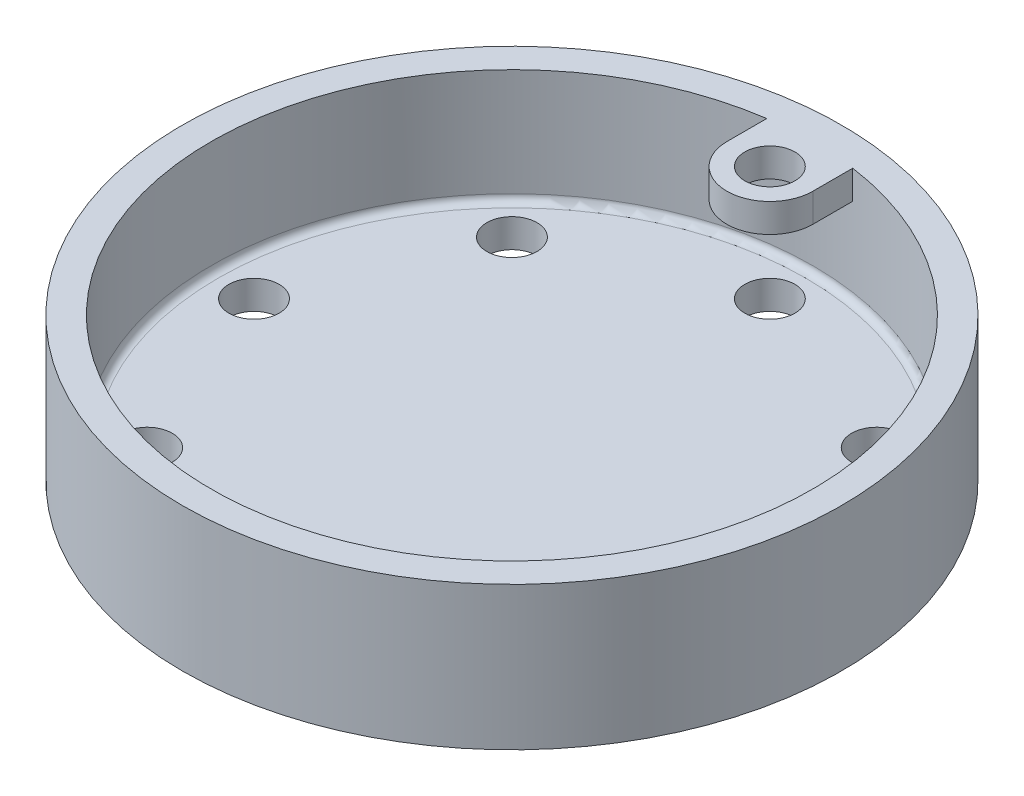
from build123d import *

# Parameters (mm, degrees)
SKETCH1_R           = 73.025
BASE_EXTRUDE_DEPTH  = 31.75
SHELL1_T            = -6.35
BOSS_EXTRUDE1_START = -6.35
BOSS_EXTRUDE1_DEPTH = 6.35
CUT_EXTRUDE1_REACH  = 110.043
SKETCH3_R           = 5.55625
SKETCH5_R           = 5.55625
CUT_EXTRUDE3_DEPTH  = 107.350652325
CIRPATTERN2_COUNT   = 8
FILLET2_R           = 1.5875


with BuildPart() as part:
    # Sketch1 → Base-Extrude (new body)
    with BuildSketch(Plane(origin=(0, 0, 0), x_dir=(1, 0, 0), z_dir=(0, 1, 0))):
        with Locations(Location((0, 0, 0), (0, 0, 270))):
            Circle(SKETCH1_R)
    extrude(amount=BASE_EXTRUDE_DEPTH)

    # Shell1
    shell1_openings = [part.faces().sort_by_distance(p)[0] for p in [
        (0, 31.75, 0),
    ]]
    offset(amount=SHELL1_T, openings=shell1_openings, kind=Kind.INTERSECTION)

    # Sketch2 → Boss-Extrude1 (add)
    with BuildSketch(Plane(origin=(0, 31.75, 0), x_dir=(-1, 0, 0), z_dir=(0, 1, 0)).offset(BOSS_EXTRUDE1_START)):
        with BuildLine():
            Line((-9.525, -65.991135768), (-9.525, -57.15))
            ThreePointArc((-9.525, -57.15), (0, -47.625), (9.525, -57.15))
            Line((9.525, -57.15), (9.525, -65.991135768))
            ThreePointArc((9.525, -65.991135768), (0, -66.675), (-9.525, -65.991135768))
        make_face()
    extrude(amount=BOSS_EXTRUDE1_DEPTH)

    # Sketch3 → Cut-Extrude1 (cut, up to next)
    with BuildSketch(Plane(origin=(0, 31.75, 0), x_dir=(-1, 0, 0), z_dir=(0, 1, 0)), mode=Mode.PRIVATE) as cut_extrude1_sk1:
        with Locations(Location((0, -57.15, 0), (0, 0, 90))):
            Circle(SKETCH3_R)
    cut_extrude1_tool1 = extrude(cut_extrude1_sk1.sketch, amount=-CUT_EXTRUDE1_REACH, mode=Mode.PRIVATE) & part.part
    add(cut_extrude1_tool1.solids().sort_by_distance((0, 31.75, -57.15))[0], mode=Mode.SUBTRACT)

    # Sketch5 → Cut-Extrude3 (cut, through all)
    with BuildSketch(Plane(origin=(0, 6.35, 0), x_dir=(-1, 0, 0), z_dir=(0, 1, 0))):
        with Locations(Location((0, -57.15, 0), (0, 0, 90))):
            Circle(SKETCH5_R)
    cut_extrude3 = extrude(amount=-CUT_EXTRUDE3_DEPTH, mode=Mode.SUBTRACT)

    # CirPattern2: Cut-Extrude3 ×8 about axis
    cirpattern2_axis = Axis((0, 0, 0), (0, 1, 0))
    for i in range(1, CIRPATTERN2_COUNT):
        add(cut_extrude3.rotate(cirpattern2_axis, i * 360 / CIRPATTERN2_COUNT), mode=Mode.SUBTRACT)

    # Fillet2
    fillet2_edges = [part.edges().sort_by_distance(p)[0] for p in [
        (0, 6.35, -66.675),
    ]]
    fillet(fillet2_edges, radius=FILLET2_R)


solid = part.part
